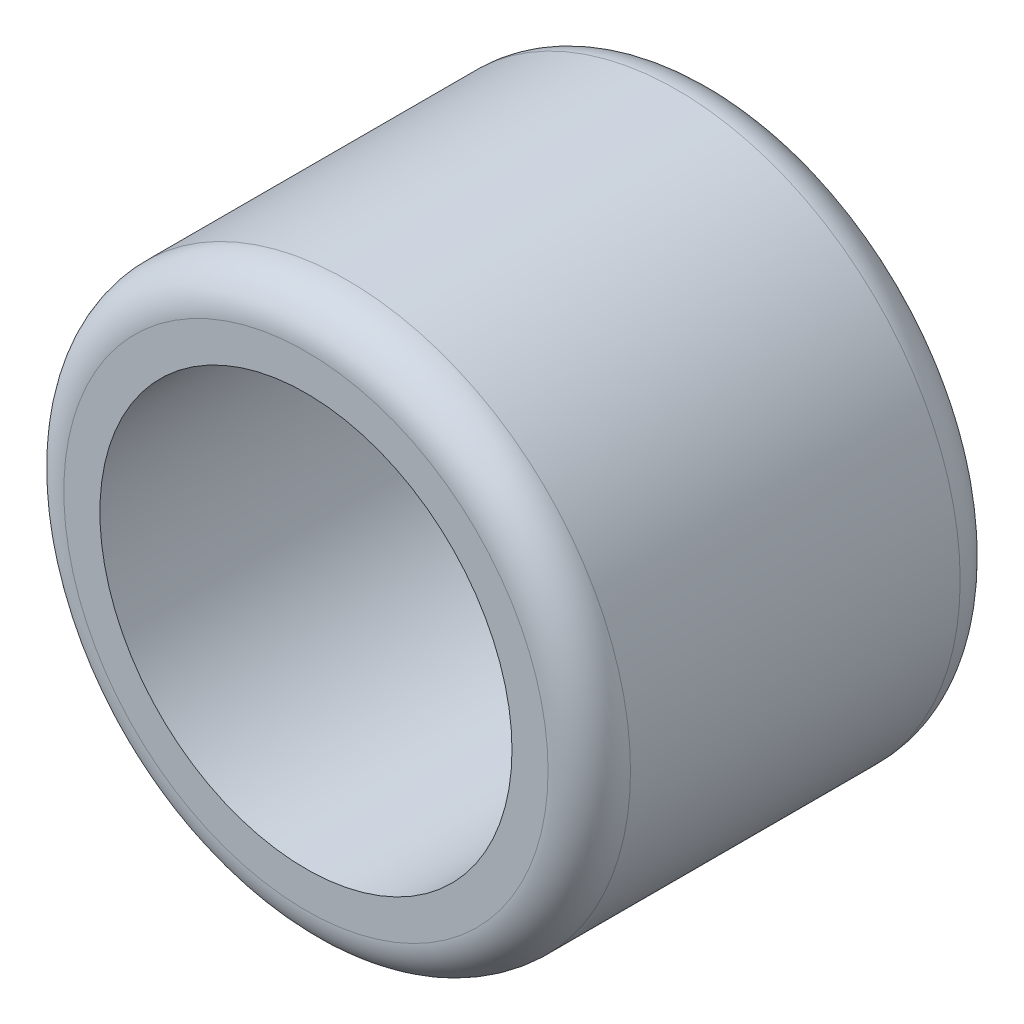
ISO-10303-21;
HEADER;
FILE_DESCRIPTION(('STEP AP214'),'2;1');
FILE_NAME('part.step','',(''),(''),'','','');
FILE_SCHEMA(('AUTOMOTIVE_DESIGN { 1 0 10303 214 1 1 1 1 }'));
ENDSEC;
DATA;
#1=APPLICATION_CONTEXT('core data for automotive mechanical design processes');
#2=APPLICATION_PROTOCOL_DEFINITION('international standard','automotive_design',2000,#1);
#3=PRODUCT_CONTEXT('',#1,'mechanical');
#4=PRODUCT('Part','Part','',(#3));
#5=PRODUCT_RELATED_PRODUCT_CATEGORY('part','',(#4));
#6=PRODUCT_DEFINITION_FORMATION('','',#4);
#7=PRODUCT_DEFINITION_CONTEXT('part definition',#1,'design');
#8=PRODUCT_DEFINITION('design','',#6,#7);
#9=PRODUCT_DEFINITION_SHAPE('','',#8);
#10=(LENGTH_UNIT() NAMED_UNIT(*) SI_UNIT(.MILLI.,.METRE.));
#11=(NAMED_UNIT(*) PLANE_ANGLE_UNIT() SI_UNIT($,.RADIAN.));
#12=(NAMED_UNIT(*) SI_UNIT($,.STERADIAN.) SOLID_ANGLE_UNIT());
#13=UNCERTAINTY_MEASURE_WITH_UNIT(LENGTH_MEASURE(1.E-05),#10,'distance_accuracy_value','');
#14=(GEOMETRIC_REPRESENTATION_CONTEXT(3) GLOBAL_UNCERTAINTY_ASSIGNED_CONTEXT((#13)) GLOBAL_UNIT_ASSIGNED_CONTEXT((#10,
#11,#12)) REPRESENTATION_CONTEXT('',''));
#15=CARTESIAN_POINT('',(0.,0.,0.));
#16=DIRECTION('',(0.,0.,1.));
#17=DIRECTION('',(1.,0.,0.));
#18=AXIS2_PLACEMENT_3D('',#15,#16,#17);
#19=CARTESIAN_POINT('',(0.,0.,12.7));
#20=DIRECTION('',(0.,0.,1.));
#21=DIRECTION('',(1.,0.,0.));
#22=AXIS2_PLACEMENT_3D('',#19,#20,#21);
#23=PLANE('',#22);
#24=CARTESIAN_POINT('',(0.,0.,12.7));
#25=DIRECTION('',(0.,0.,1.));
#26=DIRECTION('',(1.,0.,0.));
#27=AXIS2_PLACEMENT_3D('',#24,#25,#26);
#28=CIRCLE('',#27,7.46125);
#29=CARTESIAN_POINT('',(7.46125,0.,12.7));
#30=VERTEX_POINT('',#29);
#31=EDGE_CURVE('E10',#30,#30,#28,.T.);
#32=ORIENTED_EDGE('',*,*,#31,.T.);
#33=EDGE_LOOP('',(#32));
#34=FACE_BOUND('',#33,.T.);
#35=CARTESIAN_POINT('',(0.,0.,12.7));
#36=DIRECTION('',(0.,0.,1.));
#37=DIRECTION('',(1.,0.,0.));
#38=AXIS2_PLACEMENT_3D('',#35,#36,#37);
#39=CIRCLE('',#38,6.35);
#40=CARTESIAN_POINT('',(6.35,0.,12.7));
#41=VERTEX_POINT('',#40);
#42=EDGE_CURVE('E51',#41,#41,#39,.T.);
#43=ORIENTED_EDGE('',*,*,#42,.F.);
#44=EDGE_LOOP('',(#43));
#45=FACE_BOUND('',#44,.T.);
#46=ADVANCED_FACE('F31',(#34,#45),#23,.T.);
#47=CARTESIAN_POINT('',(0.,0.,0.));
#48=DIRECTION('',(0.,0.,1.));
#49=DIRECTION('',(1.,0.,0.));
#50=AXIS2_PLACEMENT_3D('',#47,#48,#49);
#51=PLANE('',#50);
#52=CARTESIAN_POINT('',(0.,0.,0.));
#53=DIRECTION('',(0.,0.,1.));
#54=DIRECTION('',(1.,0.,0.));
#55=AXIS2_PLACEMENT_3D('',#52,#53,#54);
#56=CIRCLE('',#55,7.46125);
#57=CARTESIAN_POINT('',(7.46125,0.,0.));
#58=VERTEX_POINT('',#57);
#59=EDGE_CURVE('E38',#58,#58,#56,.F.);
#60=ORIENTED_EDGE('',*,*,#59,.T.);
#61=EDGE_LOOP('',(#60));
#62=FACE_BOUND('',#61,.T.);
#63=CARTESIAN_POINT('',(0.,0.,0.));
#64=DIRECTION('',(0.,0.,1.));
#65=DIRECTION('',(1.,0.,0.));
#66=AXIS2_PLACEMENT_3D('',#63,#64,#65);
#67=CIRCLE('',#66,6.35);
#68=CARTESIAN_POINT('',(6.35,0.,0.));
#69=VERTEX_POINT('',#68);
#70=EDGE_CURVE('E52',#69,#69,#67,.T.);
#71=ORIENTED_EDGE('',*,*,#70,.T.);
#72=EDGE_LOOP('',(#71));
#73=FACE_BOUND('',#72,.T.);
#74=ADVANCED_FACE('F62',(#62,#73),#51,.F.);
#75=CARTESIAN_POINT('',(0.,0.,12.7));
#76=DIRECTION('',(0.,0.,-1.));
#77=DIRECTION('',(-1.,0.,0.));
#78=AXIS2_PLACEMENT_3D('',#75,#76,#77);
#79=CYLINDRICAL_SURFACE('',#78,8.73125);
#80=CARTESIAN_POINT('',(0.,0.,1.27));
#81=DIRECTION('',(0.,0.,1.));
#82=DIRECTION('',(1.,0.,0.));
#83=AXIS2_PLACEMENT_3D('',#80,#81,#82);
#84=CIRCLE('',#83,8.73125);
#85=CARTESIAN_POINT('',(8.73125,0.,1.27));
#86=VERTEX_POINT('',#85);
#87=EDGE_CURVE('E42',#86,#86,#84,.T.);
#88=ORIENTED_EDGE('',*,*,#87,.T.);
#89=EDGE_LOOP('',(#88));
#90=FACE_BOUND('',#89,.T.);
#91=CARTESIAN_POINT('',(0.,0.,11.43));
#92=DIRECTION('',(0.,0.,1.));
#93=DIRECTION('',(1.,0.,0.));
#94=AXIS2_PLACEMENT_3D('',#91,#92,#93);
#95=CIRCLE('',#94,8.73125);
#96=CARTESIAN_POINT('',(8.73125,0.,11.43));
#97=VERTEX_POINT('',#96);
#98=EDGE_CURVE('E46',#97,#97,#95,.F.);
#99=ORIENTED_EDGE('',*,*,#98,.T.);
#100=EDGE_LOOP('',(#99));
#101=FACE_BOUND('',#100,.T.);
#102=ADVANCED_FACE('F67',(#90,#101),#79,.T.);
#103=CARTESIAN_POINT('',(0.,0.,12.7));
#104=DIRECTION('',(0.,0.,-1.));
#105=DIRECTION('',(-1.,0.,0.));
#106=AXIS2_PLACEMENT_3D('',#103,#104,#105);
#107=CYLINDRICAL_SURFACE('',#106,6.35);
#108=ORIENTED_EDGE('',*,*,#42,.T.);
#109=EDGE_LOOP('',(#108));
#110=FACE_BOUND('',#109,.T.);
#111=ORIENTED_EDGE('',*,*,#70,.F.);
#112=EDGE_LOOP('',(#111));
#113=FACE_BOUND('',#112,.T.);
#114=ADVANCED_FACE('F58',(#110,#113),#107,.F.);
#115=CARTESIAN_POINT('',(0.,0.,1.27));
#116=DIRECTION('',(0.,0.,1.));
#117=DIRECTION('',(1.,0.,0.));
#118=AXIS2_PLACEMENT_3D('',#115,#116,#117);
#119=TOROIDAL_SURFACE('',#118,7.46125,1.27);
#120=ORIENTED_EDGE('',*,*,#59,.F.);
#121=EDGE_LOOP('',(#120));
#122=FACE_BOUND('',#121,.T.);
#123=ORIENTED_EDGE('',*,*,#87,.F.);
#124=EDGE_LOOP('',(#123));
#125=FACE_BOUND('',#124,.T.);
#126=ADVANCED_FACE('F73',(#122,#125),#119,.T.);
#127=CARTESIAN_POINT('',(0.,0.,11.43));
#128=DIRECTION('',(0.,0.,1.));
#129=DIRECTION('',(1.,0.,0.));
#130=AXIS2_PLACEMENT_3D('',#127,#128,#129);
#131=TOROIDAL_SURFACE('',#130,7.46125,1.27);
#132=ORIENTED_EDGE('',*,*,#98,.F.);
#133=EDGE_LOOP('',(#132));
#134=FACE_BOUND('',#133,.T.);
#135=ORIENTED_EDGE('',*,*,#31,.F.);
#136=EDGE_LOOP('',(#135));
#137=FACE_BOUND('',#136,.T.);
#138=ADVANCED_FACE('F33',(#134,#137),#131,.T.);
#139=CLOSED_SHELL('',(#46,#74,#102,#114,#126,#138));
#140=MANIFOLD_SOLID_BREP('B2',#139);
#141=ADVANCED_BREP_SHAPE_REPRESENTATION('',(#18,#140),#14);
#142=SHAPE_DEFINITION_REPRESENTATION(#9,#141);
ENDSEC;
END-ISO-10303-21;
